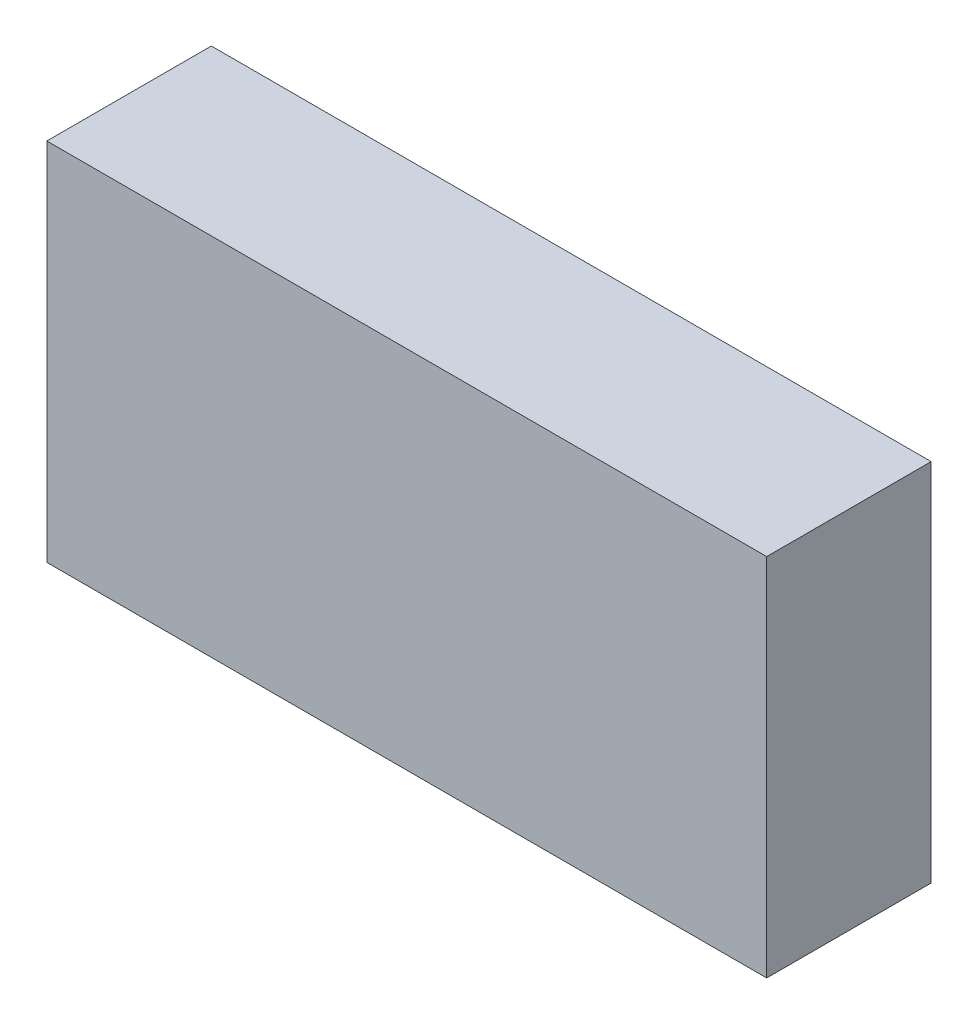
ISO-10303-21;
HEADER;
FILE_DESCRIPTION(('STEP AP214'),'2;1');
FILE_NAME('part.step','',(''),(''),'','','');
FILE_SCHEMA(('AUTOMOTIVE_DESIGN { 1 0 10303 214 1 1 1 1 }'));
ENDSEC;
DATA;
#1=APPLICATION_CONTEXT('core data for automotive mechanical design processes');
#2=APPLICATION_PROTOCOL_DEFINITION('international standard','automotive_design',2000,#1);
#3=PRODUCT_CONTEXT('',#1,'mechanical');
#4=PRODUCT('Part','Part','',(#3));
#5=PRODUCT_RELATED_PRODUCT_CATEGORY('part','',(#4));
#6=PRODUCT_DEFINITION_FORMATION('','',#4);
#7=PRODUCT_DEFINITION_CONTEXT('part definition',#1,'design');
#8=PRODUCT_DEFINITION('design','',#6,#7);
#9=PRODUCT_DEFINITION_SHAPE('','',#8);
#10=(LENGTH_UNIT() NAMED_UNIT(*) SI_UNIT(.MILLI.,.METRE.));
#11=(NAMED_UNIT(*) PLANE_ANGLE_UNIT() SI_UNIT($,.RADIAN.));
#12=(NAMED_UNIT(*) SI_UNIT($,.STERADIAN.) SOLID_ANGLE_UNIT());
#13=UNCERTAINTY_MEASURE_WITH_UNIT(LENGTH_MEASURE(1.E-05),#10,'distance_accuracy_value','');
#14=(GEOMETRIC_REPRESENTATION_CONTEXT(3) GLOBAL_UNCERTAINTY_ASSIGNED_CONTEXT((#13)) GLOBAL_UNIT_ASSIGNED_CONTEXT((#10,
#11,#12)) REPRESENTATION_CONTEXT('',''));
#15=CARTESIAN_POINT('',(0.,0.,0.));
#16=DIRECTION('',(0.,0.,1.));
#17=DIRECTION('',(1.,0.,0.));
#18=AXIS2_PLACEMENT_3D('',#15,#16,#17);
#19=CARTESIAN_POINT('',(0.,0.,0.457));
#20=DIRECTION('',(0.,0.,1.));
#21=DIRECTION('',(1.,0.,0.));
#22=AXIS2_PLACEMENT_3D('',#19,#20,#21);
#23=PLANE('',#22);
#24=DIRECTION('',(0.,1.,0.));
#25=VECTOR('',#24,1.);
#26=CARTESIAN_POINT('',(-1.,0.,0.457));
#27=LINE('',#26,#25);
#28=CARTESIAN_POINT('',(-1.,0.507,0.457));
#29=VERTEX_POINT('',#28);
#30=CARTESIAN_POINT('',(-1.,-0.507,0.457));
#31=VERTEX_POINT('',#30);
#32=EDGE_CURVE('E20',#29,#31,#27,.F.);
#33=ORIENTED_EDGE('',*,*,#32,.T.);
#34=DIRECTION('',(1.,0.,0.));
#35=VECTOR('',#34,1.);
#36=CARTESIAN_POINT('',(-1.,-0.507,0.457));
#37=LINE('',#36,#35);
#38=CARTESIAN_POINT('',(1.,-0.507,0.457));
#39=VERTEX_POINT('',#38);
#40=EDGE_CURVE('E68',#39,#31,#37,.F.);
#41=ORIENTED_EDGE('',*,*,#40,.F.);
#42=DIRECTION('',(0.,1.,0.));
#43=VECTOR('',#42,1.);
#44=CARTESIAN_POINT('',(1.,0.075,0.457));
#45=LINE('',#44,#43);
#46=CARTESIAN_POINT('',(1.,0.507,0.457));
#47=VERTEX_POINT('',#46);
#48=EDGE_CURVE('E58',#47,#39,#45,.F.);
#49=ORIENTED_EDGE('',*,*,#48,.F.);
#50=DIRECTION('',(1.,0.,0.));
#51=VECTOR('',#50,1.);
#52=CARTESIAN_POINT('',(1.,0.507,0.457));
#53=LINE('',#52,#51);
#54=EDGE_CURVE('E53',#29,#47,#53,.T.);
#55=ORIENTED_EDGE('',*,*,#54,.F.);
#56=EDGE_LOOP('',(#33,#41,#49,#55));
#57=FACE_BOUND('',#56,.T.);
#58=ADVANCED_FACE('F17',(#57),#23,.T.);
#59=CARTESIAN_POINT('',(-1.,-0.507,0.));
#60=DIRECTION('',(0.,-1.,0.));
#61=DIRECTION('',(0.,0.,-1.));
#62=AXIS2_PLACEMENT_3D('',#59,#60,#61);
#63=PLANE('',#62);
#64=DIRECTION('',(0.,0.,1.));
#65=VECTOR('',#64,1.);
#66=CARTESIAN_POINT('',(-1.,-0.507,0.));
#67=LINE('',#66,#65);
#68=CARTESIAN_POINT('',(-1.,-0.507,0.));
#69=VERTEX_POINT('',#68);
#70=EDGE_CURVE('E81',#69,#31,#67,.T.);
#71=ORIENTED_EDGE('',*,*,#70,.F.);
#72=DIRECTION('',(1.,0.,0.));
#73=VECTOR('',#72,1.);
#74=CARTESIAN_POINT('',(0.,-0.507,0.));
#75=LINE('',#74,#73);
#76=CARTESIAN_POINT('',(1.,-0.507,0.));
#77=VERTEX_POINT('',#76);
#78=EDGE_CURVE('E75',#69,#77,#75,.T.);
#79=ORIENTED_EDGE('',*,*,#78,.T.);
#80=DIRECTION('',(0.,0.,-1.));
#81=VECTOR('',#80,1.);
#82=CARTESIAN_POINT('',(1.,-0.507,0.));
#83=LINE('',#82,#81);
#84=EDGE_CURVE('E62',#39,#77,#83,.T.);
#85=ORIENTED_EDGE('',*,*,#84,.F.);
#86=ORIENTED_EDGE('',*,*,#40,.T.);
#87=EDGE_LOOP('',(#71,#79,#85,#86));
#88=FACE_BOUND('',#87,.T.);
#89=ADVANCED_FACE('F73',(#88),#63,.T.);
#90=CARTESIAN_POINT('',(1.,0.075,0.));
#91=DIRECTION('',(1.,0.,0.));
#92=DIRECTION('',(0.,0.,-1.));
#93=AXIS2_PLACEMENT_3D('',#90,#91,#92);
#94=PLANE('',#93);
#95=ORIENTED_EDGE('',*,*,#48,.T.);
#96=ORIENTED_EDGE('',*,*,#84,.T.);
#97=DIRECTION('',(0.,1.,0.));
#98=VECTOR('',#97,1.);
#99=CARTESIAN_POINT('',(1.,0.,0.));
#100=LINE('',#99,#98);
#101=CARTESIAN_POINT('',(1.,0.507,0.));
#102=VERTEX_POINT('',#101);
#103=EDGE_CURVE('E84',#77,#102,#100,.T.);
#104=ORIENTED_EDGE('',*,*,#103,.T.);
#105=DIRECTION('',(0.,0.,1.));
#106=VECTOR('',#105,1.);
#107=CARTESIAN_POINT('',(1.,0.507,0.));
#108=LINE('',#107,#106);
#109=EDGE_CURVE('E64',#47,#102,#108,.F.);
#110=ORIENTED_EDGE('',*,*,#109,.F.);
#111=EDGE_LOOP('',(#95,#96,#104,#110));
#112=FACE_BOUND('',#111,.T.);
#113=ADVANCED_FACE('F60',(#112),#94,.T.);
#114=CARTESIAN_POINT('',(1.,0.507,0.));
#115=DIRECTION('',(0.,1.,0.));
#116=DIRECTION('',(0.,0.,1.));
#117=AXIS2_PLACEMENT_3D('',#114,#115,#116);
#118=PLANE('',#117);
#119=ORIENTED_EDGE('',*,*,#109,.T.);
#120=DIRECTION('',(1.,0.,0.));
#121=VECTOR('',#120,1.);
#122=CARTESIAN_POINT('',(0.,0.507,0.));
#123=LINE('',#122,#121);
#124=CARTESIAN_POINT('',(-1.,0.507,0.));
#125=VERTEX_POINT('',#124);
#126=EDGE_CURVE('E26',#102,#125,#123,.F.);
#127=ORIENTED_EDGE('',*,*,#126,.T.);
#128=DIRECTION('',(0.,0.,1.));
#129=VECTOR('',#128,1.);
#130=CARTESIAN_POINT('',(-1.,0.507,0.));
#131=LINE('',#130,#129);
#132=EDGE_CURVE('E34',#29,#125,#131,.F.);
#133=ORIENTED_EDGE('',*,*,#132,.F.);
#134=ORIENTED_EDGE('',*,*,#54,.T.);
#135=EDGE_LOOP('',(#119,#127,#133,#134));
#136=FACE_BOUND('',#135,.T.);
#137=ADVANCED_FACE('F88',(#136),#118,.T.);
#138=CARTESIAN_POINT('',(-1.,-0.075,0.));
#139=DIRECTION('',(-1.,0.,0.));
#140=DIRECTION('',(0.,0.,1.));
#141=AXIS2_PLACEMENT_3D('',#138,#139,#140);
#142=PLANE('',#141);
#143=ORIENTED_EDGE('',*,*,#32,.F.);
#144=ORIENTED_EDGE('',*,*,#132,.T.);
#145=DIRECTION('',(0.,1.,0.));
#146=VECTOR('',#145,1.);
#147=CARTESIAN_POINT('',(-1.,0.,0.));
#148=LINE('',#147,#146);
#149=EDGE_CURVE('E11',#125,#69,#148,.F.);
#150=ORIENTED_EDGE('',*,*,#149,.T.);
#151=ORIENTED_EDGE('',*,*,#70,.T.);
#152=EDGE_LOOP('',(#143,#144,#150,#151));
#153=FACE_BOUND('',#152,.T.);
#154=ADVANCED_FACE('F91',(#153),#142,.T.);
#155=CARTESIAN_POINT('',(0.,0.,0.));
#156=DIRECTION('',(0.,0.,1.));
#157=DIRECTION('',(1.,0.,0.));
#158=AXIS2_PLACEMENT_3D('',#155,#156,#157);
#159=PLANE('',#158);
#160=ORIENTED_EDGE('',*,*,#78,.F.);
#161=ORIENTED_EDGE('',*,*,#149,.F.);
#162=ORIENTED_EDGE('',*,*,#126,.F.);
#163=ORIENTED_EDGE('',*,*,#103,.F.);
#164=EDGE_LOOP('',(#160,#161,#162,#163));
#165=FACE_BOUND('',#164,.T.);
#166=ADVANCED_FACE('F90',(#165),#159,.F.);
#167=CLOSED_SHELL('',(#58,#89,#113,#137,#154,#166));
#168=MANIFOLD_SOLID_BREP('B1',#167);
#169=ADVANCED_BREP_SHAPE_REPRESENTATION('',(#18,#168),#14);
#170=SHAPE_DEFINITION_REPRESENTATION(#9,#169);
ENDSEC;
END-ISO-10303-21;
